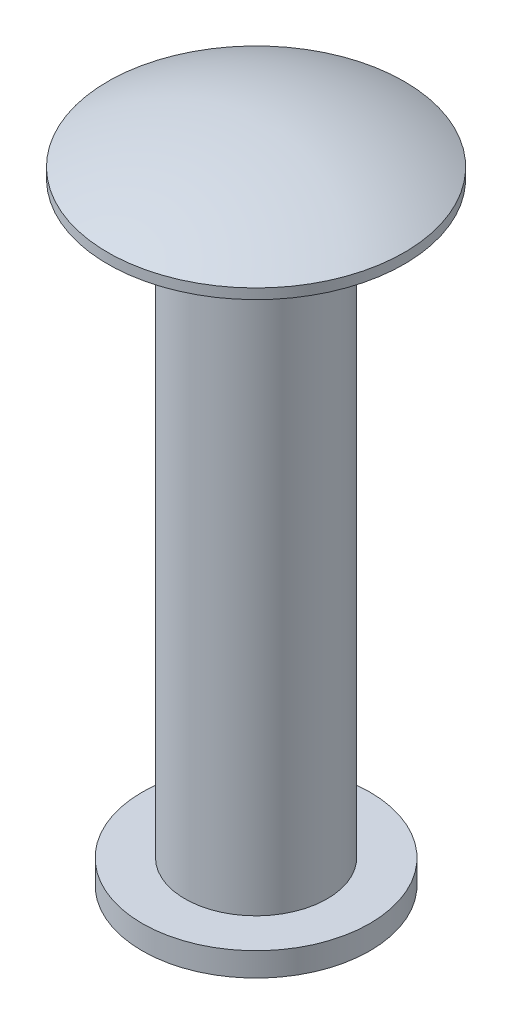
ISO-10303-21;
HEADER;
FILE_DESCRIPTION(('STEP AP214'),'2;1');
FILE_NAME('part.step','',(''),(''),'','','');
FILE_SCHEMA(('AUTOMOTIVE_DESIGN { 1 0 10303 214 1 1 1 1 }'));
ENDSEC;
DATA;
#1=APPLICATION_CONTEXT('core data for automotive mechanical design processes');
#2=APPLICATION_PROTOCOL_DEFINITION('international standard','automotive_design',2000,#1);
#3=PRODUCT_CONTEXT('',#1,'mechanical');
#4=PRODUCT('Part','Part','',(#3));
#5=PRODUCT_RELATED_PRODUCT_CATEGORY('part','',(#4));
#6=PRODUCT_DEFINITION_FORMATION('','',#4);
#7=PRODUCT_DEFINITION_CONTEXT('part definition',#1,'design');
#8=PRODUCT_DEFINITION('design','',#6,#7);
#9=PRODUCT_DEFINITION_SHAPE('','',#8);
#10=(LENGTH_UNIT() NAMED_UNIT(*) SI_UNIT(.MILLI.,.METRE.));
#11=(NAMED_UNIT(*) PLANE_ANGLE_UNIT() SI_UNIT($,.RADIAN.));
#12=(NAMED_UNIT(*) SI_UNIT($,.STERADIAN.) SOLID_ANGLE_UNIT());
#13=UNCERTAINTY_MEASURE_WITH_UNIT(LENGTH_MEASURE(1.E-05),#10,'distance_accuracy_value','');
#14=(GEOMETRIC_REPRESENTATION_CONTEXT(3) GLOBAL_UNCERTAINTY_ASSIGNED_CONTEXT((#13)) GLOBAL_UNIT_ASSIGNED_CONTEXT((#10,
#11,#12)) REPRESENTATION_CONTEXT('',''));
#15=CARTESIAN_POINT('',(0.,0.,0.));
#16=DIRECTION('',(0.,0.,1.));
#17=DIRECTION('',(1.,0.,0.));
#18=AXIS2_PLACEMENT_3D('',#15,#16,#17);
#19=CARTESIAN_POINT('',(7.9,2.8575,-34.1));
#20=DIRECTION('',(0.,1.,0.));
#21=DIRECTION('',(0.,0.,1.));
#22=AXIS2_PLACEMENT_3D('',#19,#20,#21);
#23=PLANE('',#22);
#24=CARTESIAN_POINT('',(7.9,2.8575,-34.1));
#25=DIRECTION('',(0.,-1.,0.));
#26=DIRECTION('',(0.,0.,-1.));
#27=AXIS2_PLACEMENT_3D('',#24,#25,#26);
#28=CIRCLE('',#27,0.45);
#29=CARTESIAN_POINT('',(7.9,2.8575,-34.55));
#30=VERTEX_POINT('',#29);
#31=EDGE_CURVE('E19',#30,#30,#28,.T.);
#32=ORIENTED_EDGE('',*,*,#31,.T.);
#33=EDGE_LOOP('',(#32));
#34=FACE_BOUND('',#33,.T.);
#35=ADVANCED_FACE('F15',(#34),#23,.F.);
#36=CARTESIAN_POINT('',(7.9,5.1575,-34.1));
#37=DIRECTION('',(0.,-1.,0.));
#38=DIRECTION('',(0.,0.,-1.));
#39=AXIS2_PLACEMENT_3D('',#36,#37,#38);
#40=CYLINDRICAL_SURFACE('',#39,0.45);
#41=CARTESIAN_POINT('',(7.90000000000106,1.88249999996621,-34.0999999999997));
#42=DIRECTION('',(2.35788952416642E-12,-1.,7.11111839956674E-13));
#43=DIRECTION('',(-1.,-2.35777832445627E-12,0.));
#44=AXIS2_PLACEMENT_3D('',#41,#42,#43);
#45=CIRCLE('',#44,0.449999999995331);
#46=CARTESIAN_POINT('',(7.45000000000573,1.88249999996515,-34.0999999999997));
#47=VERTEX_POINT('',#46);
#48=EDGE_CURVE('E31',#47,#47,#45,.T.);
#49=ORIENTED_EDGE('',*,*,#48,.T.);
#50=EDGE_LOOP('',(#49));
#51=FACE_BOUND('',#50,.T.);
#52=ORIENTED_EDGE('',*,*,#31,.F.);
#53=EDGE_LOOP('',(#52));
#54=FACE_BOUND('',#53,.T.);
#55=ADVANCED_FACE('F54',(#51,#54),#40,.F.);
#56=CARTESIAN_POINT('',(7.90000000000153,1.68249999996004,-34.0999999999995));
#57=DIRECTION('',(2.35822312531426E-12,-1.,7.11236625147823E-13));
#58=DIRECTION('',(1.,2.35822312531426E-12,0.));
#59=AXIS2_PLACEMENT_3D('',#56,#57,#58);
#60=CONICAL_SURFACE('',#59,0.65000000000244,0.785398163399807);
#61=ORIENTED_EDGE('',*,*,#48,.F.);
#62=EDGE_LOOP('',(#61));
#63=FACE_BOUND('',#62,.T.);
#64=CARTESIAN_POINT('',(7.90000000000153,1.68249999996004,-34.0999999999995));
#65=DIRECTION('',(2.35822312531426E-12,-1.,7.11236625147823E-13));
#66=DIRECTION('',(1.,2.35822312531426E-12,0.));
#67=AXIS2_PLACEMENT_3D('',#64,#65,#66);
#68=CIRCLE('',#67,0.650000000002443);
#69=CARTESIAN_POINT('',(8.55000000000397,1.68249999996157,-34.0999999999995));
#70=VERTEX_POINT('',#69);
#71=EDGE_CURVE('E43',#70,#70,#68,.T.);
#72=ORIENTED_EDGE('',*,*,#71,.T.);
#73=EDGE_LOOP('',(#72));
#74=FACE_BOUND('',#73,.T.);
#75=ADVANCED_FACE('F56',(#63,#74),#60,.F.);
#76=CARTESIAN_POINT('',(7.45,1.6825,-34.1));
#77=DIRECTION('',(0.,1.,0.));
#78=DIRECTION('',(0.,0.,1.));
#79=AXIS2_PLACEMENT_3D('',#76,#77,#78);
#80=PLANE('',#79);
#81=ORIENTED_EDGE('',*,*,#71,.F.);
#82=EDGE_LOOP('',(#81));
#83=FACE_BOUND('',#82,.T.);
#84=CARTESIAN_POINT('',(7.9,1.6825,-34.1));
#85=DIRECTION('',(0.,-1.,0.));
#86=DIRECTION('',(0.,0.,-1.));
#87=AXIS2_PLACEMENT_3D('',#84,#85,#86);
#88=CIRCLE('',#87,1.2);
#89=CARTESIAN_POINT('',(7.9,1.6825,-35.3));
#90=VERTEX_POINT('',#89);
#91=EDGE_CURVE('E41',#90,#90,#88,.F.);
#92=ORIENTED_EDGE('',*,*,#91,.F.);
#93=EDGE_LOOP('',(#92));
#94=FACE_BOUND('',#93,.T.);
#95=ADVANCED_FACE('F63',(#83,#94),#80,.F.);
#96=CARTESIAN_POINT('',(7.9,5.33250000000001,-34.1));
#97=DIRECTION('',(-0.877582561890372,0.,0.479425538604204));
#98=DIRECTION('',(0.231052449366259,0.876206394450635,0.422938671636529));
#99=AXIS2_PLACEMENT_3D('',#96,#97,#98);
#100=SPHERICAL_SURFACE('',#99,3.3);
#101=CARTESIAN_POINT('',(7.9,5.33250000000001,-34.1));
#102=DIRECTION('',(0.,-1.,0.));
#103=DIRECTION('',(0.,0.,-1.));
#104=AXIS2_PLACEMENT_3D('',#101,#102,#103);
#105=SPHERICAL_SURFACE('',#104,3.3);
#106=CARTESIAN_POINT('',(7.9,8.23914647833,-34.1));
#107=DIRECTION('',(0.,-1.,0.));
#108=DIRECTION('',(0.,0.,-1.));
#109=AXIS2_PLACEMENT_3D('',#106,#107,#108);
#110=CIRCLE('',#109,1.5625);
#111=CARTESIAN_POINT('',(7.9,8.23914647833,-35.6625));
#112=VERTEX_POINT('',#111);
#113=EDGE_CURVE('E38',#112,#112,#110,.T.);
#114=ORIENTED_EDGE('',*,*,#113,.F.);
#115=EDGE_LOOP('',(#114));
#116=FACE_BOUND('',#115,.T.);
#117=ADVANCED_FACE('F17',(#116),#105,.T.);
#118=CARTESIAN_POINT('',(7.9,5.1575,-34.1));
#119=DIRECTION('',(0.,-1.,0.));
#120=DIRECTION('',(0.,0.,-1.));
#121=AXIS2_PLACEMENT_3D('',#118,#119,#120);
#122=CYLINDRICAL_SURFACE('',#121,1.2);
#123=CARTESIAN_POINT('',(7.9,1.9325,-34.1));
#124=DIRECTION('',(0.,-1.,0.));
#125=DIRECTION('',(0.,0.,-1.));
#126=AXIS2_PLACEMENT_3D('',#123,#124,#125);
#127=CIRCLE('',#126,1.2);
#128=CARTESIAN_POINT('',(7.9,1.9325,-35.3));
#129=VERTEX_POINT('',#128);
#130=EDGE_CURVE('E35',#129,#129,#127,.F.);
#131=ORIENTED_EDGE('',*,*,#130,.F.);
#132=EDGE_LOOP('',(#131));
#133=FACE_BOUND('',#132,.T.);
#134=ORIENTED_EDGE('',*,*,#91,.T.);
#135=EDGE_LOOP('',(#134));
#136=FACE_BOUND('',#135,.T.);
#137=ADVANCED_FACE('F83',(#133,#136),#122,.T.);
#138=CARTESIAN_POINT('',(7.9,5.1575,-34.1));
#139=DIRECTION('',(0.,-1.,0.));
#140=DIRECTION('',(0.,0.,-1.));
#141=AXIS2_PLACEMENT_3D('',#138,#139,#140);
#142=CYLINDRICAL_SURFACE('',#141,1.5625);
#143=ORIENTED_EDGE('',*,*,#113,.T.);
#144=EDGE_LOOP('',(#143));
#145=FACE_BOUND('',#144,.T.);
#146=CARTESIAN_POINT('',(7.9,8.1325,-34.1));
#147=DIRECTION('',(0.,-1.,0.));
#148=DIRECTION('',(0.,0.,-1.));
#149=AXIS2_PLACEMENT_3D('',#146,#147,#148);
#150=CIRCLE('',#149,1.5625);
#151=CARTESIAN_POINT('',(7.9,8.1325,-35.6625));
#152=VERTEX_POINT('',#151);
#153=EDGE_CURVE('E28',#152,#152,#150,.F.);
#154=ORIENTED_EDGE('',*,*,#153,.T.);
#155=EDGE_LOOP('',(#154));
#156=FACE_BOUND('',#155,.T.);
#157=ADVANCED_FACE('F79',(#145,#156),#142,.T.);
#158=CARTESIAN_POINT('',(6.7,1.9325,-34.1));
#159=DIRECTION('',(0.,1.,0.));
#160=DIRECTION('',(0.,0.,1.));
#161=AXIS2_PLACEMENT_3D('',#158,#159,#160);
#162=PLANE('',#161);
#163=CARTESIAN_POINT('',(7.9,1.9325,-34.1));
#164=DIRECTION('',(0.,-1.,0.));
#165=DIRECTION('',(0.,0.,-1.));
#166=AXIS2_PLACEMENT_3D('',#163,#164,#165);
#167=CIRCLE('',#166,0.75);
#168=CARTESIAN_POINT('',(7.9,1.9325,-34.85));
#169=VERTEX_POINT('',#168);
#170=EDGE_CURVE('E23',#169,#169,#167,.F.);
#171=ORIENTED_EDGE('',*,*,#170,.F.);
#172=EDGE_LOOP('',(#171));
#173=FACE_BOUND('',#172,.T.);
#174=ORIENTED_EDGE('',*,*,#130,.T.);
#175=EDGE_LOOP('',(#174));
#176=FACE_BOUND('',#175,.T.);
#177=ADVANCED_FACE('F73',(#173,#176),#162,.T.);
#178=CARTESIAN_POINT('',(7.15,8.1325,-34.1));
#179=DIRECTION('',(0.,1.,0.));
#180=DIRECTION('',(0.,0.,1.));
#181=AXIS2_PLACEMENT_3D('',#178,#179,#180);
#182=PLANE('',#181);
#183=CARTESIAN_POINT('',(7.9,8.1325,-34.1));
#184=DIRECTION('',(0.,-1.,0.));
#185=DIRECTION('',(0.,0.,-1.));
#186=AXIS2_PLACEMENT_3D('',#183,#184,#185);
#187=CIRCLE('',#186,0.75);
#188=CARTESIAN_POINT('',(7.9,8.1325,-34.85));
#189=VERTEX_POINT('',#188);
#190=EDGE_CURVE('E9',#189,#189,#187,.T.);
#191=ORIENTED_EDGE('',*,*,#190,.F.);
#192=EDGE_LOOP('',(#191));
#193=FACE_BOUND('',#192,.T.);
#194=ORIENTED_EDGE('',*,*,#153,.F.);
#195=EDGE_LOOP('',(#194));
#196=FACE_BOUND('',#195,.T.);
#197=ADVANCED_FACE('F68',(#193,#196),#182,.F.);
#198=CARTESIAN_POINT('',(7.9,5.1575,-34.1));
#199=DIRECTION('',(0.,-1.,0.));
#200=DIRECTION('',(0.,0.,-1.));
#201=AXIS2_PLACEMENT_3D('',#198,#199,#200);
#202=CYLINDRICAL_SURFACE('',#201,0.75);
#203=ORIENTED_EDGE('',*,*,#170,.T.);
#204=EDGE_LOOP('',(#203));
#205=FACE_BOUND('',#204,.T.);
#206=ORIENTED_EDGE('',*,*,#190,.T.);
#207=EDGE_LOOP('',(#206));
#208=FACE_BOUND('',#207,.T.);
#209=ADVANCED_FACE('F66',(#205,#208),#202,.T.);
#210=CLOSED_SHELL('',(#35,#55,#75,#95,#117,#137,#157,#177,#197,#209));
#211=MANIFOLD_SOLID_BREP('B1',#210);
#212=ADVANCED_BREP_SHAPE_REPRESENTATION('',(#18,#211),#14);
#213=SHAPE_DEFINITION_REPRESENTATION(#9,#212);
ENDSEC;
END-ISO-10303-21;
